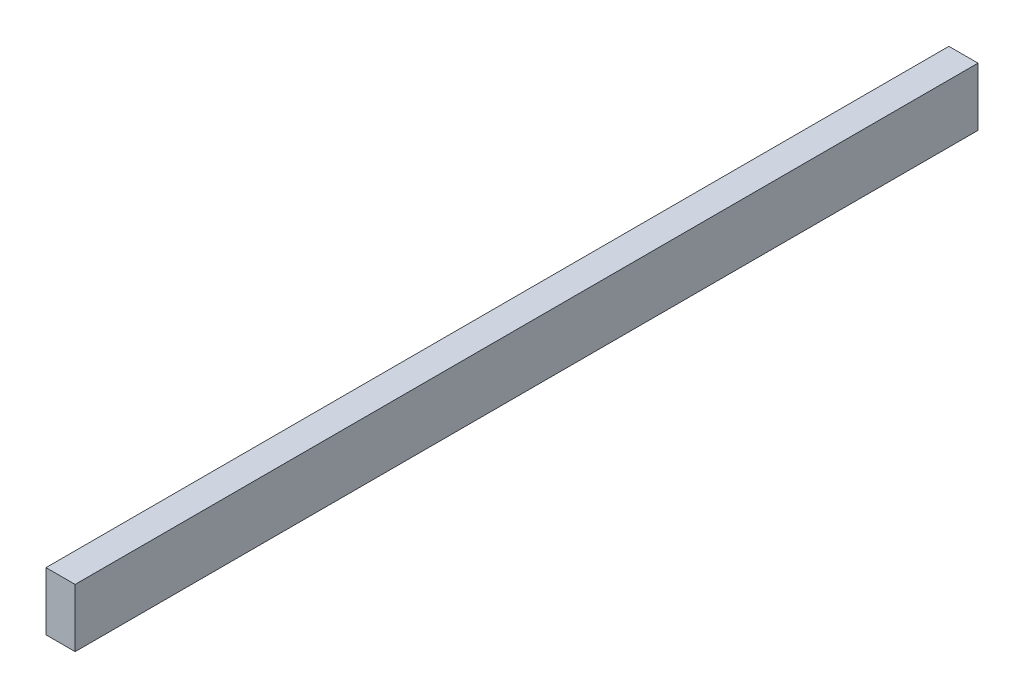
ISO-10303-21;
HEADER;
FILE_DESCRIPTION(('STEP AP214'),'2;1');
FILE_NAME('part.step','',(''),(''),'','','');
FILE_SCHEMA(('AUTOMOTIVE_DESIGN { 1 0 10303 214 1 1 1 1 }'));
ENDSEC;
DATA;
#1=APPLICATION_CONTEXT('core data for automotive mechanical design processes');
#2=APPLICATION_PROTOCOL_DEFINITION('international standard','automotive_design',2000,#1);
#3=PRODUCT_CONTEXT('',#1,'mechanical');
#4=PRODUCT('Part','Part','',(#3));
#5=PRODUCT_RELATED_PRODUCT_CATEGORY('part','',(#4));
#6=PRODUCT_DEFINITION_FORMATION('','',#4);
#7=PRODUCT_DEFINITION_CONTEXT('part definition',#1,'design');
#8=PRODUCT_DEFINITION('design','',#6,#7);
#9=PRODUCT_DEFINITION_SHAPE('','',#8);
#10=(LENGTH_UNIT() NAMED_UNIT(*) SI_UNIT(.MILLI.,.METRE.));
#11=(NAMED_UNIT(*) PLANE_ANGLE_UNIT() SI_UNIT($,.RADIAN.));
#12=(NAMED_UNIT(*) SI_UNIT($,.STERADIAN.) SOLID_ANGLE_UNIT());
#13=UNCERTAINTY_MEASURE_WITH_UNIT(LENGTH_MEASURE(1.E-05),#10,'distance_accuracy_value','');
#14=(GEOMETRIC_REPRESENTATION_CONTEXT(3) GLOBAL_UNCERTAINTY_ASSIGNED_CONTEXT((#13)) GLOBAL_UNIT_ASSIGNED_CONTEXT((#10,
#11,#12)) REPRESENTATION_CONTEXT('',''));
#15=CARTESIAN_POINT('',(0.,0.,0.));
#16=DIRECTION('',(0.,0.,1.));
#17=DIRECTION('',(1.,0.,0.));
#18=AXIS2_PLACEMENT_3D('',#15,#16,#17);
#19=CARTESIAN_POINT('',(0.,0.,465.));
#20=DIRECTION('',(1.,0.,0.));
#21=DIRECTION('',(0.,0.,-1.));
#22=AXIS2_PLACEMENT_3D('',#19,#20,#21);
#23=PLANE('',#22);
#24=DIRECTION('',(0.,-1.,0.));
#25=VECTOR('',#24,1.);
#26=CARTESIAN_POINT('',(0.,0.,0.));
#27=LINE('',#26,#25);
#28=CARTESIAN_POINT('',(0.,30.,0.));
#29=VERTEX_POINT('',#28);
#30=CARTESIAN_POINT('',(0.,0.,0.));
#31=VERTEX_POINT('',#30);
#32=EDGE_CURVE('E76',#29,#31,#27,.T.);
#33=ORIENTED_EDGE('',*,*,#32,.T.);
#34=DIRECTION('',(0.,0.,-1.));
#35=VECTOR('',#34,1.);
#36=CARTESIAN_POINT('',(0.,0.,465.));
#37=LINE('',#36,#35);
#38=CARTESIAN_POINT('',(0.,0.,465.));
#39=VERTEX_POINT('',#38);
#40=EDGE_CURVE('E11',#39,#31,#37,.T.);
#41=ORIENTED_EDGE('',*,*,#40,.F.);
#42=DIRECTION('',(0.,-1.,0.));
#43=VECTOR('',#42,1.);
#44=CARTESIAN_POINT('',(0.,0.,465.));
#45=LINE('',#44,#43);
#46=CARTESIAN_POINT('',(0.,30.,465.));
#47=VERTEX_POINT('',#46);
#48=EDGE_CURVE('E94',#47,#39,#45,.T.);
#49=ORIENTED_EDGE('',*,*,#48,.F.);
#50=DIRECTION('',(0.,0.,-1.));
#51=VECTOR('',#50,1.);
#52=CARTESIAN_POINT('',(0.,30.,465.));
#53=LINE('',#52,#51);
#54=EDGE_CURVE('E88',#47,#29,#53,.T.);
#55=ORIENTED_EDGE('',*,*,#54,.T.);
#56=EDGE_LOOP('',(#33,#41,#49,#55));
#57=FACE_BOUND('',#56,.T.);
#58=ADVANCED_FACE('F32',(#57),#23,.F.);
#59=CARTESIAN_POINT('',(0.,0.,465.));
#60=DIRECTION('',(0.,1.,0.));
#61=DIRECTION('',(0.,0.,1.));
#62=AXIS2_PLACEMENT_3D('',#59,#60,#61);
#63=PLANE('',#62);
#64=DIRECTION('',(1.,0.,0.));
#65=VECTOR('',#64,1.);
#66=CARTESIAN_POINT('',(0.,0.,0.));
#67=LINE('',#66,#65);
#68=CARTESIAN_POINT('',(15.,0.,0.));
#69=VERTEX_POINT('',#68);
#70=EDGE_CURVE('E72',#31,#69,#67,.T.);
#71=ORIENTED_EDGE('',*,*,#70,.T.);
#72=DIRECTION('',(0.,0.,-1.));
#73=VECTOR('',#72,1.);
#74=CARTESIAN_POINT('',(15.,0.,465.));
#75=LINE('',#74,#73);
#76=CARTESIAN_POINT('',(15.,0.,465.));
#77=VERTEX_POINT('',#76);
#78=EDGE_CURVE('E39',#77,#69,#75,.T.);
#79=ORIENTED_EDGE('',*,*,#78,.F.);
#80=DIRECTION('',(1.,0.,0.));
#81=VECTOR('',#80,1.);
#82=CARTESIAN_POINT('',(0.,0.,465.));
#83=LINE('',#82,#81);
#84=EDGE_CURVE('E84',#39,#77,#83,.T.);
#85=ORIENTED_EDGE('',*,*,#84,.F.);
#86=ORIENTED_EDGE('',*,*,#40,.T.);
#87=EDGE_LOOP('',(#71,#79,#85,#86));
#88=FACE_BOUND('',#87,.T.);
#89=ADVANCED_FACE('F83',(#88),#63,.F.);
#90=CARTESIAN_POINT('',(15.,0.,465.));
#91=DIRECTION('',(-1.,0.,0.));
#92=DIRECTION('',(0.,0.,1.));
#93=AXIS2_PLACEMENT_3D('',#90,#91,#92);
#94=PLANE('',#93);
#95=DIRECTION('',(0.,1.,0.));
#96=VECTOR('',#95,1.);
#97=CARTESIAN_POINT('',(15.,0.,0.));
#98=LINE('',#97,#96);
#99=CARTESIAN_POINT('',(15.,30.,0.));
#100=VERTEX_POINT('',#99);
#101=EDGE_CURVE('E77',#69,#100,#98,.T.);
#102=ORIENTED_EDGE('',*,*,#101,.T.);
#103=DIRECTION('',(0.,0.,-1.));
#104=VECTOR('',#103,1.);
#105=CARTESIAN_POINT('',(15.,30.,465.));
#106=LINE('',#105,#104);
#107=CARTESIAN_POINT('',(15.,30.,465.));
#108=VERTEX_POINT('',#107);
#109=EDGE_CURVE('E100',#108,#100,#106,.T.);
#110=ORIENTED_EDGE('',*,*,#109,.F.);
#111=DIRECTION('',(0.,1.,0.));
#112=VECTOR('',#111,1.);
#113=CARTESIAN_POINT('',(15.,0.,465.));
#114=LINE('',#113,#112);
#115=EDGE_CURVE('E51',#77,#108,#114,.T.);
#116=ORIENTED_EDGE('',*,*,#115,.F.);
#117=ORIENTED_EDGE('',*,*,#78,.T.);
#118=EDGE_LOOP('',(#102,#110,#116,#117));
#119=FACE_BOUND('',#118,.T.);
#120=ADVANCED_FACE('F103',(#119),#94,.F.);
#121=CARTESIAN_POINT('',(0.,30.,465.));
#122=DIRECTION('',(0.,-1.,0.));
#123=DIRECTION('',(0.,0.,-1.));
#124=AXIS2_PLACEMENT_3D('',#121,#122,#123);
#125=PLANE('',#124);
#126=DIRECTION('',(-1.,0.,0.));
#127=VECTOR('',#126,1.);
#128=CARTESIAN_POINT('',(0.,30.,0.));
#129=LINE('',#128,#127);
#130=EDGE_CURVE('E92',#100,#29,#129,.T.);
#131=ORIENTED_EDGE('',*,*,#130,.T.);
#132=ORIENTED_EDGE('',*,*,#54,.F.);
#133=DIRECTION('',(-1.,0.,0.));
#134=VECTOR('',#133,1.);
#135=CARTESIAN_POINT('',(0.,30.,465.));
#136=LINE('',#135,#134);
#137=EDGE_CURVE('E46',#108,#47,#136,.T.);
#138=ORIENTED_EDGE('',*,*,#137,.F.);
#139=ORIENTED_EDGE('',*,*,#109,.T.);
#140=EDGE_LOOP('',(#131,#132,#138,#139));
#141=FACE_BOUND('',#140,.T.);
#142=ADVANCED_FACE('F105',(#141),#125,.F.);
#143=CARTESIAN_POINT('',(0.,30.,465.));
#144=DIRECTION('',(0.,0.,-1.));
#145=DIRECTION('',(-1.,0.,0.));
#146=AXIS2_PLACEMENT_3D('',#143,#144,#145);
#147=PLANE('',#146);
#148=ORIENTED_EDGE('',*,*,#48,.T.);
#149=ORIENTED_EDGE('',*,*,#84,.T.);
#150=ORIENTED_EDGE('',*,*,#115,.T.);
#151=ORIENTED_EDGE('',*,*,#137,.T.);
#152=EDGE_LOOP('',(#148,#149,#150,#151));
#153=FACE_BOUND('',#152,.T.);
#154=ADVANCED_FACE('F106',(#153),#147,.F.);
#155=CARTESIAN_POINT('',(0.,30.,0.));
#156=DIRECTION('',(0.,0.,-1.));
#157=DIRECTION('',(-1.,0.,0.));
#158=AXIS2_PLACEMENT_3D('',#155,#156,#157);
#159=PLANE('',#158);
#160=ORIENTED_EDGE('',*,*,#32,.F.);
#161=ORIENTED_EDGE('',*,*,#130,.F.);
#162=ORIENTED_EDGE('',*,*,#101,.F.);
#163=ORIENTED_EDGE('',*,*,#70,.F.);
#164=EDGE_LOOP('',(#160,#161,#162,#163));
#165=FACE_BOUND('',#164,.T.);
#166=ADVANCED_FACE('F73',(#165),#159,.T.);
#167=CLOSED_SHELL('',(#58,#89,#120,#142,#154,#166));
#168=MANIFOLD_SOLID_BREP('B2',#167);
#169=ADVANCED_BREP_SHAPE_REPRESENTATION('',(#18,#168),#14);
#170=SHAPE_DEFINITION_REPRESENTATION(#9,#169);
ENDSEC;
END-ISO-10303-21;
